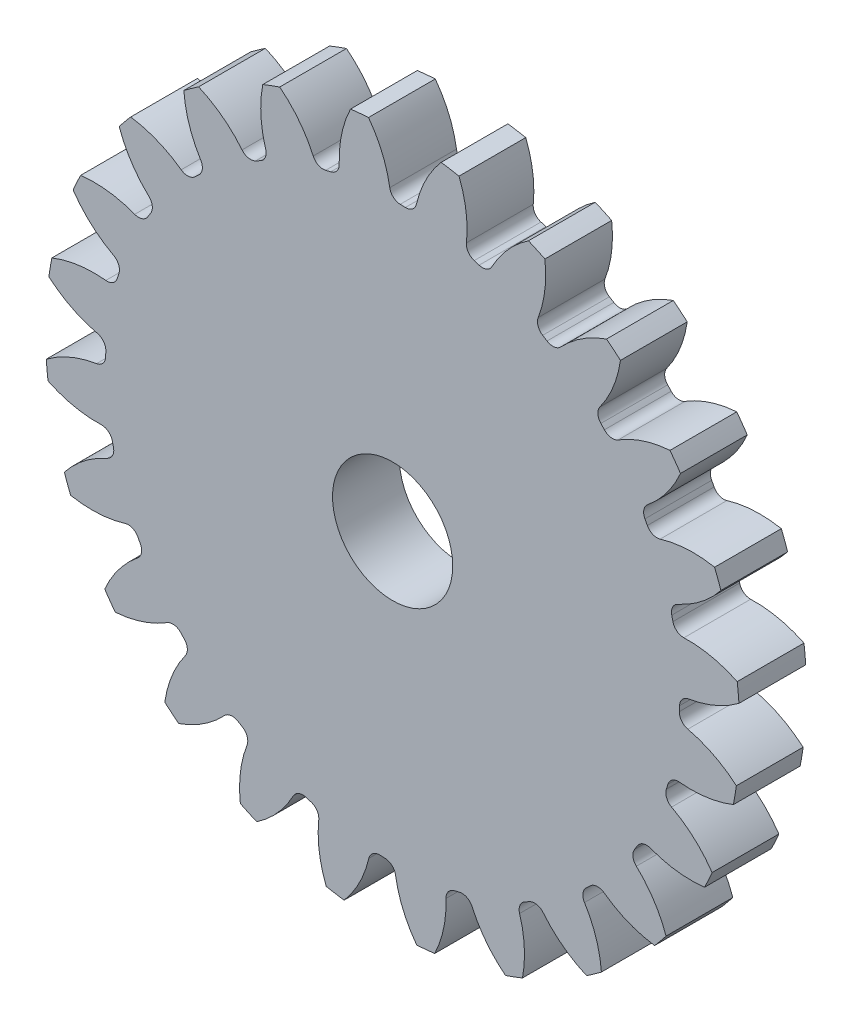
from build123d import *

# Parameters (mm, degrees)
SKETCH3_R         = 660.4
GEARBODY_DEPTH    = 127
TOOTHCUT_DEPTH    = 943.541946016
CIRPATTERN1_COUNT = 24
BOREDIA_R         = 114.3
BORE_DEPTH        = 12700


with BuildPart() as part:
    # Sketch3 → gearBody (new body)
    with BuildSketch(Plane.XY):
        Circle(SKETCH3_R)
    extrude(amount=GEARBODY_DEPTH)

    # Sketch2 → toothCut (cut, through all)
    with BuildSketch(Plane.XY):
        with BuildLine():
            ThreePointArc((545.562977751, -24.212544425), (545.758562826, -19.308057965), (545.91005858, -14.402011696))
            ThreePointArc((545.91005858, -14.402011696), (551.02771628, -1.321766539), (563.322082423, 5.47027254))
            ThreePointArc((563.322082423, 5.47027254), (614.435218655, 20.24424996), (660.4, 47.040928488))
            ThreePointArc((660.4, 47.040928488), (661.659318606, -23.408439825), (655.424609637, -93.592681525))
            ThreePointArc((655.424609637, -93.592681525), (611.468422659, -63.614744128), (561.527128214, -45.265623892))
            ThreePointArc((561.527128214, -45.265623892), (549.743481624, -37.621743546), (545.562977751, -24.212544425))
        make_face()
    toothcut = extrude(amount=TOOTHCUT_DEPTH, mode=Mode.SUBTRACT)

    # CirPattern1: toothCut ×24 about axis
    cirpattern1_axis = Axis((0, 0, 0), (0, 0, 1))
    for i in range(1, CIRPATTERN1_COUNT):
        add(toothcut.rotate(cirpattern1_axis, i * 360 / CIRPATTERN1_COUNT), mode=Mode.SUBTRACT)

    # boreDia → bore (cut, symmetric)
    with BuildSketch(Plane.XY):
        Circle(BOREDIA_R)
    extrude(amount=BORE_DEPTH, both=True, mode=Mode.SUBTRACT)


solid = part.part
